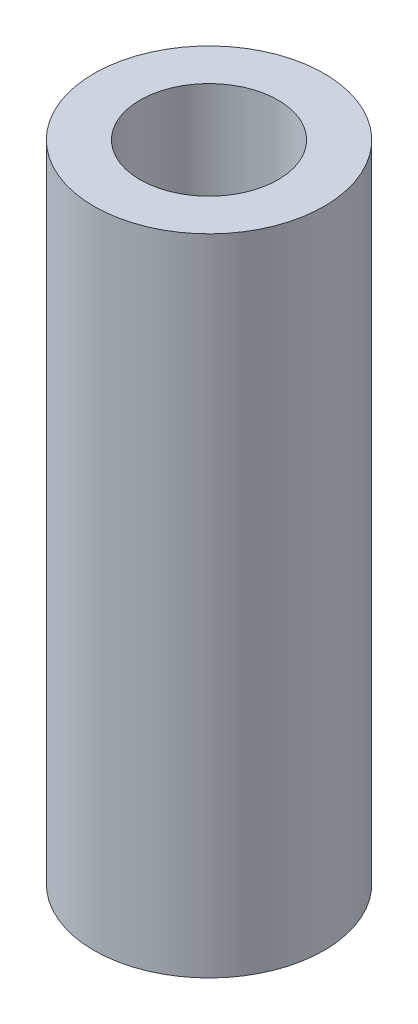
ISO-10303-21;
HEADER;
FILE_DESCRIPTION(('STEP AP214'),'2;1');
FILE_NAME('part.step','',(''),(''),'','','');
FILE_SCHEMA(('AUTOMOTIVE_DESIGN { 1 0 10303 214 1 1 1 1 }'));
ENDSEC;
DATA;
#1=APPLICATION_CONTEXT('core data for automotive mechanical design processes');
#2=APPLICATION_PROTOCOL_DEFINITION('international standard','automotive_design',2000,#1);
#3=PRODUCT_CONTEXT('',#1,'mechanical');
#4=PRODUCT('Part','Part','',(#3));
#5=PRODUCT_RELATED_PRODUCT_CATEGORY('part','',(#4));
#6=PRODUCT_DEFINITION_FORMATION('','',#4);
#7=PRODUCT_DEFINITION_CONTEXT('part definition',#1,'design');
#8=PRODUCT_DEFINITION('design','',#6,#7);
#9=PRODUCT_DEFINITION_SHAPE('','',#8);
#10=(LENGTH_UNIT() NAMED_UNIT(*) SI_UNIT(.MILLI.,.METRE.));
#11=(NAMED_UNIT(*) PLANE_ANGLE_UNIT() SI_UNIT($,.RADIAN.));
#12=(NAMED_UNIT(*) SI_UNIT($,.STERADIAN.) SOLID_ANGLE_UNIT());
#13=UNCERTAINTY_MEASURE_WITH_UNIT(LENGTH_MEASURE(1.E-05),#10,'distance_accuracy_value','');
#14=(GEOMETRIC_REPRESENTATION_CONTEXT(3) GLOBAL_UNCERTAINTY_ASSIGNED_CONTEXT((#13)) GLOBAL_UNIT_ASSIGNED_CONTEXT((#10,
#11,#12)) REPRESENTATION_CONTEXT('',''));
#15=CARTESIAN_POINT('',(0.,0.,0.));
#16=DIRECTION('',(0.,0.,1.));
#17=DIRECTION('',(1.,0.,0.));
#18=AXIS2_PLACEMENT_3D('',#15,#16,#17);
#19=CARTESIAN_POINT('',(0.,7.,0.));
#20=DIRECTION('',(0.,1.,0.));
#21=DIRECTION('',(0.,0.,1.));
#22=AXIS2_PLACEMENT_3D('',#19,#20,#21);
#23=PLANE('',#22);
#24=CARTESIAN_POINT('',(0.,7.,0.));
#25=DIRECTION('',(0.,1.,0.));
#26=DIRECTION('',(0.,0.,1.));
#27=AXIS2_PLACEMENT_3D('',#24,#25,#26);
#28=CIRCLE('',#27,1.25);
#29=CARTESIAN_POINT('',(0.,7.,1.25));
#30=VERTEX_POINT('',#29);
#31=EDGE_CURVE('E10',#30,#30,#28,.T.);
#32=ORIENTED_EDGE('',*,*,#31,.T.);
#33=EDGE_LOOP('',(#32));
#34=FACE_BOUND('',#33,.T.);
#35=CARTESIAN_POINT('',(0.,7.,0.));
#36=DIRECTION('',(0.,1.,0.));
#37=DIRECTION('',(0.,0.,1.));
#38=AXIS2_PLACEMENT_3D('',#35,#36,#37);
#39=CIRCLE('',#38,0.75);
#40=CARTESIAN_POINT('',(0.,7.,0.75));
#41=VERTEX_POINT('',#40);
#42=EDGE_CURVE('E42',#41,#41,#39,.T.);
#43=ORIENTED_EDGE('',*,*,#42,.F.);
#44=EDGE_LOOP('',(#43));
#45=FACE_BOUND('',#44,.T.);
#46=ADVANCED_FACE('F31',(#34,#45),#23,.T.);
#47=CARTESIAN_POINT('',(0.,0.,0.));
#48=DIRECTION('',(0.,1.,0.));
#49=DIRECTION('',(0.,0.,1.));
#50=AXIS2_PLACEMENT_3D('',#47,#48,#49);
#51=PLANE('',#50);
#52=CARTESIAN_POINT('',(0.,0.,0.));
#53=DIRECTION('',(0.,1.,0.));
#54=DIRECTION('',(0.,0.,1.));
#55=AXIS2_PLACEMENT_3D('',#52,#53,#54);
#56=CIRCLE('',#55,1.25);
#57=CARTESIAN_POINT('',(0.,0.,1.25));
#58=VERTEX_POINT('',#57);
#59=EDGE_CURVE('E35',#58,#58,#56,.T.);
#60=ORIENTED_EDGE('',*,*,#59,.F.);
#61=EDGE_LOOP('',(#60));
#62=FACE_BOUND('',#61,.T.);
#63=CARTESIAN_POINT('',(0.,0.,0.));
#64=DIRECTION('',(0.,1.,0.));
#65=DIRECTION('',(0.,0.,1.));
#66=AXIS2_PLACEMENT_3D('',#63,#64,#65);
#67=CIRCLE('',#66,0.75);
#68=CARTESIAN_POINT('',(0.,0.,0.75));
#69=VERTEX_POINT('',#68);
#70=EDGE_CURVE('E44',#69,#69,#67,.T.);
#71=ORIENTED_EDGE('',*,*,#70,.T.);
#72=EDGE_LOOP('',(#71));
#73=FACE_BOUND('',#72,.T.);
#74=ADVANCED_FACE('F54',(#62,#73),#51,.F.);
#75=CARTESIAN_POINT('',(0.,7.,0.));
#76=DIRECTION('',(0.,-1.,0.));
#77=DIRECTION('',(0.,0.,-1.));
#78=AXIS2_PLACEMENT_3D('',#75,#76,#77);
#79=CYLINDRICAL_SURFACE('',#78,1.25);
#80=ORIENTED_EDGE('',*,*,#31,.F.);
#81=EDGE_LOOP('',(#80));
#82=FACE_BOUND('',#81,.T.);
#83=ORIENTED_EDGE('',*,*,#59,.T.);
#84=EDGE_LOOP('',(#83));
#85=FACE_BOUND('',#84,.T.);
#86=ADVANCED_FACE('F33',(#82,#85),#79,.T.);
#87=CARTESIAN_POINT('',(0.,7.,0.));
#88=DIRECTION('',(0.,-1.,0.));
#89=DIRECTION('',(0.,0.,-1.));
#90=AXIS2_PLACEMENT_3D('',#87,#88,#89);
#91=CYLINDRICAL_SURFACE('',#90,0.75);
#92=ORIENTED_EDGE('',*,*,#42,.T.);
#93=EDGE_LOOP('',(#92));
#94=FACE_BOUND('',#93,.T.);
#95=ORIENTED_EDGE('',*,*,#70,.F.);
#96=EDGE_LOOP('',(#95));
#97=FACE_BOUND('',#96,.T.);
#98=ADVANCED_FACE('F50',(#94,#97),#91,.F.);
#99=CLOSED_SHELL('',(#46,#74,#86,#98));
#100=MANIFOLD_SOLID_BREP('B2',#99);
#101=ADVANCED_BREP_SHAPE_REPRESENTATION('',(#18,#100),#14);
#102=SHAPE_DEFINITION_REPRESENTATION(#9,#101);
ENDSEC;
END-ISO-10303-21;
